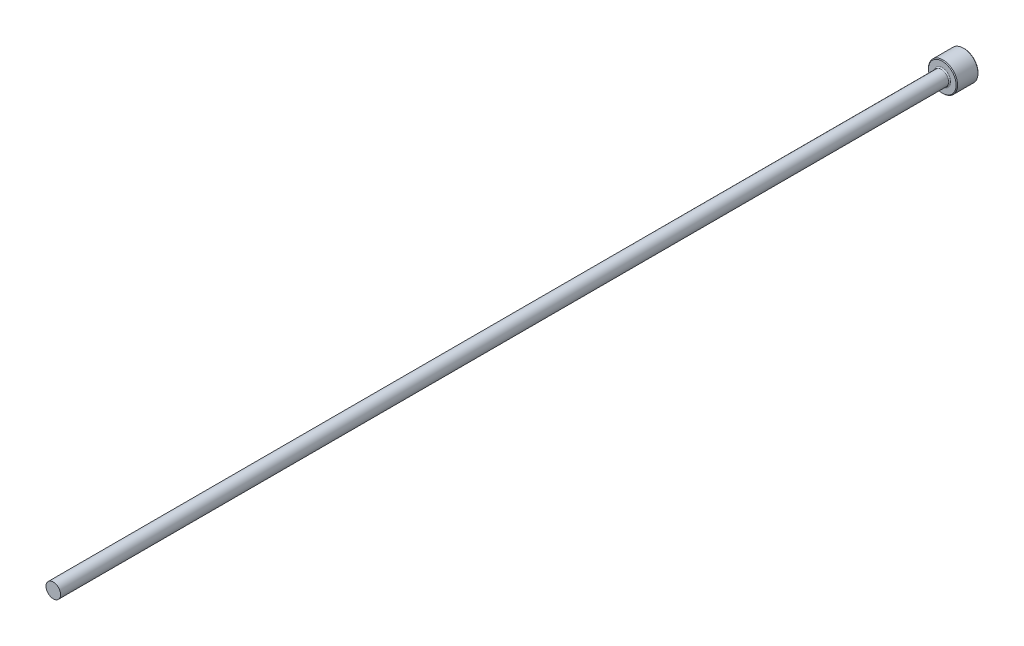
ISO-10303-21;
HEADER;
FILE_DESCRIPTION(('STEP AP214'),'2;1');
FILE_NAME('part.step','',(''),(''),'','','');
FILE_SCHEMA(('AUTOMOTIVE_DESIGN { 1 0 10303 214 1 1 1 1 }'));
ENDSEC;
DATA;
#1=APPLICATION_CONTEXT('core data for automotive mechanical design processes');
#2=APPLICATION_PROTOCOL_DEFINITION('international standard','automotive_design',2000,#1);
#3=PRODUCT_CONTEXT('',#1,'mechanical');
#4=PRODUCT('Part','Part','',(#3));
#5=PRODUCT_RELATED_PRODUCT_CATEGORY('part','',(#4));
#6=PRODUCT_DEFINITION_FORMATION('','',#4);
#7=PRODUCT_DEFINITION_CONTEXT('part definition',#1,'design');
#8=PRODUCT_DEFINITION('design','',#6,#7);
#9=PRODUCT_DEFINITION_SHAPE('','',#8);
#10=(LENGTH_UNIT() NAMED_UNIT(*) SI_UNIT(.MILLI.,.METRE.));
#11=(NAMED_UNIT(*) PLANE_ANGLE_UNIT() SI_UNIT($,.RADIAN.));
#12=(NAMED_UNIT(*) SI_UNIT($,.STERADIAN.) SOLID_ANGLE_UNIT());
#13=UNCERTAINTY_MEASURE_WITH_UNIT(LENGTH_MEASURE(1.E-05),#10,'distance_accuracy_value','');
#14=(GEOMETRIC_REPRESENTATION_CONTEXT(3) GLOBAL_UNCERTAINTY_ASSIGNED_CONTEXT((#13)) GLOBAL_UNIT_ASSIGNED_CONTEXT((#10,
#11,#12)) REPRESENTATION_CONTEXT('',''));
#15=CARTESIAN_POINT('',(0.,0.,0.));
#16=DIRECTION('',(0.,0.,1.));
#17=DIRECTION('',(1.,0.,0.));
#18=AXIS2_PLACEMENT_3D('',#15,#16,#17);
#19=CARTESIAN_POINT('',(0.,1.99999999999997,250.));
#20=DIRECTION('',(0.,0.,-1.));
#21=DIRECTION('',(-1.,0.,0.));
#22=AXIS2_PLACEMENT_3D('',#19,#20,#21);
#23=PLANE('',#22);
#24=CARTESIAN_POINT('',(0.,0.,250.));
#25=DIRECTION('',(0.,0.,1.));
#26=DIRECTION('',(1.,0.,0.));
#27=AXIS2_PLACEMENT_3D('',#24,#25,#26);
#28=CIRCLE('',#27,1.99999999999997);
#29=CARTESIAN_POINT('',(1.99999999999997,0.,250.));
#30=VERTEX_POINT('',#29);
#31=EDGE_CURVE('E50',#30,#30,#28,.T.);
#32=ORIENTED_EDGE('',*,*,#31,.T.);
#33=EDGE_LOOP('',(#32));
#34=FACE_BOUND('',#33,.T.);
#35=ADVANCED_FACE('F30',(#34),#23,.F.);
#36=CARTESIAN_POINT('',(0.,0.,109.050628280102));
#37=DIRECTION('',(0.,0.,1.));
#38=DIRECTION('',(1.,0.,0.));
#39=AXIS2_PLACEMENT_3D('',#36,#37,#38);
#40=CYLINDRICAL_SURFACE('',#39,1.99999999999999);
#41=ORIENTED_EDGE('',*,*,#31,.F.);
#42=EDGE_LOOP('',(#41));
#43=FACE_BOUND('',#42,.T.);
#44=CARTESIAN_POINT('',(0.,0.,6.3));
#45=DIRECTION('',(0.,0.,1.));
#46=DIRECTION('',(1.,0.,0.));
#47=AXIS2_PLACEMENT_3D('',#44,#45,#46);
#48=CIRCLE('',#47,2.);
#49=CARTESIAN_POINT('',(2.,0.,6.3));
#50=VERTEX_POINT('',#49);
#51=EDGE_CURVE('E53',#50,#50,#48,.T.);
#52=ORIENTED_EDGE('',*,*,#51,.T.);
#53=EDGE_LOOP('',(#52));
#54=FACE_BOUND('',#53,.T.);
#55=ADVANCED_FACE('F73',(#43,#54),#40,.T.);
#56=CARTESIAN_POINT('',(0.,0.,6.3));
#57=DIRECTION('',(0.,0.,1.));
#58=DIRECTION('',(1.,0.,0.));
#59=AXIS2_PLACEMENT_3D('',#56,#57,#58);
#60=TOROIDAL_SURFACE('',#59,2.3,0.3);
#61=ORIENTED_EDGE('',*,*,#51,.F.);
#62=EDGE_LOOP('',(#61));
#63=FACE_BOUND('',#62,.T.);
#64=CARTESIAN_POINT('',(0.,0.,6.00000000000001));
#65=DIRECTION('',(0.,0.,1.));
#66=DIRECTION('',(1.,0.,0.));
#67=AXIS2_PLACEMENT_3D('',#64,#65,#66);
#68=CIRCLE('',#67,2.3);
#69=CARTESIAN_POINT('',(2.3,0.,6.00000000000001));
#70=VERTEX_POINT('',#69);
#71=EDGE_CURVE('E56',#70,#70,#68,.T.);
#72=ORIENTED_EDGE('',*,*,#71,.T.);
#73=EDGE_LOOP('',(#72));
#74=FACE_BOUND('',#73,.T.);
#75=ADVANCED_FACE('F60',(#63,#74),#60,.F.);
#76=CARTESIAN_POINT('',(0.,4.,6.));
#77=DIRECTION('',(0.,0.,-1.));
#78=DIRECTION('',(-1.,0.,0.));
#79=AXIS2_PLACEMENT_3D('',#76,#77,#78);
#80=PLANE('',#79);
#81=CARTESIAN_POINT('',(0.,0.,6.));
#82=DIRECTION('',(0.,0.,-1.));
#83=DIRECTION('',(-1.,0.,0.));
#84=AXIS2_PLACEMENT_3D('',#81,#82,#83);
#85=CIRCLE('',#84,3.8);
#86=CARTESIAN_POINT('',(-3.8,0.,6.));
#87=VERTEX_POINT('',#86);
#88=EDGE_CURVE('E10',#87,#87,#85,.F.);
#89=ORIENTED_EDGE('',*,*,#88,.T.);
#90=EDGE_LOOP('',(#89));
#91=FACE_BOUND('',#90,.T.);
#92=ORIENTED_EDGE('',*,*,#71,.F.);
#93=EDGE_LOOP('',(#92));
#94=FACE_BOUND('',#93,.T.);
#95=ADVANCED_FACE('F62',(#91,#94),#80,.F.);
#96=CARTESIAN_POINT('',(0.,0.,109.050628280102));
#97=DIRECTION('',(0.,0.,1.));
#98=DIRECTION('',(1.,0.,0.));
#99=AXIS2_PLACEMENT_3D('',#96,#97,#98);
#100=CYLINDRICAL_SURFACE('',#99,4.);
#101=CARTESIAN_POINT('',(0.,0.,0.200000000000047));
#102=DIRECTION('',(0.,0.,1.));
#103=DIRECTION('',(1.,0.,0.));
#104=AXIS2_PLACEMENT_3D('',#101,#102,#103);
#105=CIRCLE('',#104,4.);
#106=CARTESIAN_POINT('',(4.,0.,0.200000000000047));
#107=VERTEX_POINT('',#106);
#108=EDGE_CURVE('E41',#107,#107,#105,.T.);
#109=ORIENTED_EDGE('',*,*,#108,.T.);
#110=EDGE_LOOP('',(#109));
#111=FACE_BOUND('',#110,.T.);
#112=CARTESIAN_POINT('',(0.,0.,5.8));
#113=DIRECTION('',(0.,0.,-1.));
#114=DIRECTION('',(-1.,0.,0.));
#115=AXIS2_PLACEMENT_3D('',#112,#113,#114);
#116=CIRCLE('',#115,4.);
#117=CARTESIAN_POINT('',(-4.,0.,5.8));
#118=VERTEX_POINT('',#117);
#119=EDGE_CURVE('E45',#118,#118,#116,.T.);
#120=ORIENTED_EDGE('',*,*,#119,.T.);
#121=EDGE_LOOP('',(#120));
#122=FACE_BOUND('',#121,.T.);
#123=ADVANCED_FACE('F64',(#111,#122),#100,.T.);
#124=CARTESIAN_POINT('',(0.,0.,0.));
#125=DIRECTION('',(0.,0.,1.));
#126=DIRECTION('',(1.,0.,0.));
#127=AXIS2_PLACEMENT_3D('',#124,#125,#126);
#128=PLANE('',#127);
#129=CARTESIAN_POINT('',(0.,0.,0.));
#130=DIRECTION('',(0.,0.,1.));
#131=DIRECTION('',(1.,0.,0.));
#132=AXIS2_PLACEMENT_3D('',#129,#130,#131);
#133=CIRCLE('',#132,3.79999999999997);
#134=CARTESIAN_POINT('',(3.79999999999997,0.,0.));
#135=VERTEX_POINT('',#134);
#136=EDGE_CURVE('E37',#135,#135,#133,.F.);
#137=ORIENTED_EDGE('',*,*,#136,.T.);
#138=EDGE_LOOP('',(#137));
#139=FACE_BOUND('',#138,.T.);
#140=ADVANCED_FACE('F70',(#139),#128,.F.);
#141=CARTESIAN_POINT('',(0.,0.,0.200000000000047));
#142=DIRECTION('',(0.,0.,1.));
#143=DIRECTION('',(1.,0.,0.));
#144=AXIS2_PLACEMENT_3D('',#141,#142,#143);
#145=CONICAL_SURFACE('',#144,4.,0.785398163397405);
#146=ORIENTED_EDGE('',*,*,#136,.F.);
#147=EDGE_LOOP('',(#146));
#148=FACE_BOUND('',#147,.T.);
#149=ORIENTED_EDGE('',*,*,#108,.F.);
#150=EDGE_LOOP('',(#149));
#151=FACE_BOUND('',#150,.T.);
#152=ADVANCED_FACE('F84',(#148,#151),#145,.T.);
#153=CARTESIAN_POINT('',(0.,0.,6.00000000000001));
#154=DIRECTION('',(0.,0.,-1.));
#155=DIRECTION('',(-1.,0.,0.));
#156=AXIS2_PLACEMENT_3D('',#153,#154,#155);
#157=CONICAL_SURFACE('',#156,3.8,0.78539816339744);
#158=ORIENTED_EDGE('',*,*,#119,.F.);
#159=EDGE_LOOP('',(#158));
#160=FACE_BOUND('',#159,.T.);
#161=ORIENTED_EDGE('',*,*,#88,.F.);
#162=EDGE_LOOP('',(#161));
#163=FACE_BOUND('',#162,.T.);
#164=ADVANCED_FACE('F32',(#160,#163),#157,.T.);
#165=CLOSED_SHELL('',(#35,#55,#75,#95,#123,#140,#152,#164));
#166=MANIFOLD_SOLID_BREP('B2',#165);
#167=ADVANCED_BREP_SHAPE_REPRESENTATION('',(#18,#166),#14);
#168=SHAPE_DEFINITION_REPRESENTATION(#9,#167);
ENDSEC;
END-ISO-10303-21;
